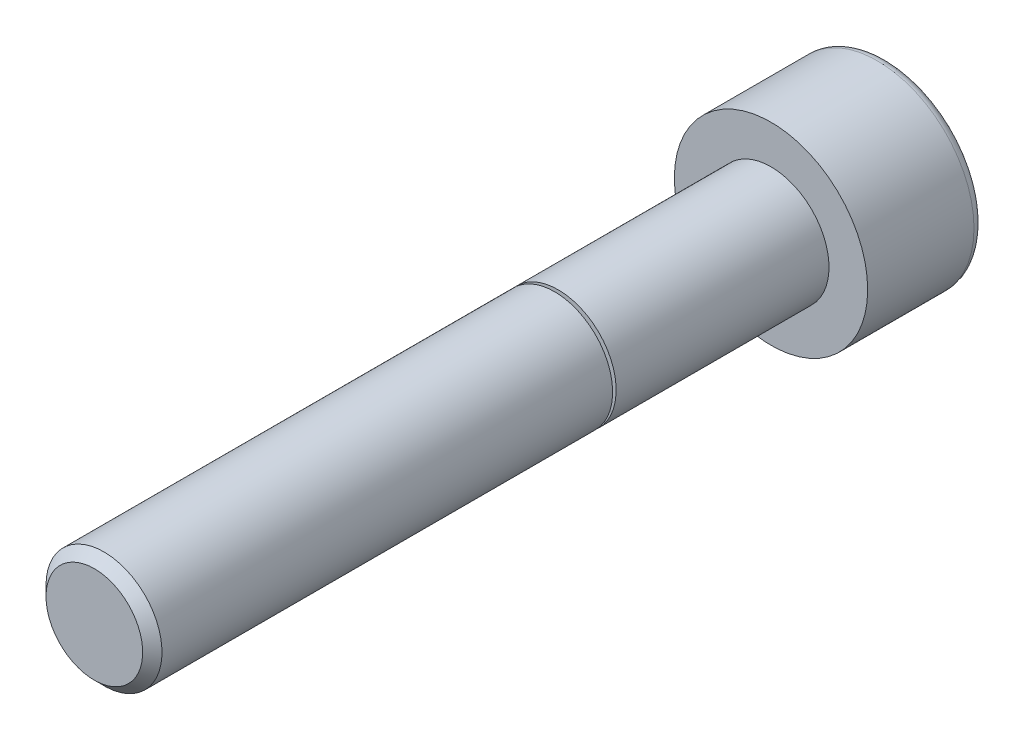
ISO-10303-21;
HEADER;
FILE_DESCRIPTION(('STEP AP214'),'2;1');
FILE_NAME('part.step','',(''),(''),'','','');
FILE_SCHEMA(('AUTOMOTIVE_DESIGN { 1 0 10303 214 1 1 1 1 }'));
ENDSEC;
DATA;
#1=APPLICATION_CONTEXT('core data for automotive mechanical design processes');
#2=APPLICATION_PROTOCOL_DEFINITION('international standard','automotive_design',2000,#1);
#3=PRODUCT_CONTEXT('',#1,'mechanical');
#4=PRODUCT('Part','Part','',(#3));
#5=PRODUCT_RELATED_PRODUCT_CATEGORY('part','',(#4));
#6=PRODUCT_DEFINITION_FORMATION('','',#4);
#7=PRODUCT_DEFINITION_CONTEXT('part definition',#1,'design');
#8=PRODUCT_DEFINITION('design','',#6,#7);
#9=PRODUCT_DEFINITION_SHAPE('','',#8);
#10=(LENGTH_UNIT() NAMED_UNIT(*) SI_UNIT(.MILLI.,.METRE.));
#11=(NAMED_UNIT(*) PLANE_ANGLE_UNIT() SI_UNIT($,.RADIAN.));
#12=(NAMED_UNIT(*) SI_UNIT($,.STERADIAN.) SOLID_ANGLE_UNIT());
#13=UNCERTAINTY_MEASURE_WITH_UNIT(LENGTH_MEASURE(1.E-05),#10,'distance_accuracy_value','');
#14=(GEOMETRIC_REPRESENTATION_CONTEXT(3) GLOBAL_UNCERTAINTY_ASSIGNED_CONTEXT((#13)) GLOBAL_UNIT_ASSIGNED_CONTEXT((#10,
#11,#12)) REPRESENTATION_CONTEXT('',''));
#15=CARTESIAN_POINT('',(0.,0.,0.));
#16=DIRECTION('',(0.,0.,1.));
#17=DIRECTION('',(1.,0.,0.));
#18=AXIS2_PLACEMENT_3D('',#15,#16,#17);
#19=CARTESIAN_POINT('',(0.,0.,-5.50000000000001));
#20=DIRECTION('',(0.,0.,-1.));
#21=DIRECTION('',(-1.,0.,0.));
#22=AXIS2_PLACEMENT_3D('',#19,#20,#21);
#23=TOROIDAL_SURFACE('',#22,4.5,0.500000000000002);
#24=CARTESIAN_POINT('',(0.,0.,-6.00000000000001));
#25=DIRECTION('',(0.,0.,-1.));
#26=DIRECTION('',(-1.,0.,0.));
#27=AXIS2_PLACEMENT_3D('',#24,#25,#26);
#28=CIRCLE('',#27,4.5);
#29=CARTESIAN_POINT('',(-4.5,0.,-6.00000000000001));
#30=VERTEX_POINT('',#29);
#31=EDGE_CURVE('E146',#30,#30,#28,.T.);
#32=ORIENTED_EDGE('',*,*,#31,.F.);
#33=EDGE_LOOP('',(#32));
#34=FACE_BOUND('',#33,.T.);
#35=CARTESIAN_POINT('',(0.,0.,-5.50000000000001));
#36=DIRECTION('',(0.,0.,-1.));
#37=DIRECTION('',(-1.,0.,0.));
#38=AXIS2_PLACEMENT_3D('',#35,#36,#37);
#39=CIRCLE('',#38,5.);
#40=CARTESIAN_POINT('',(-5.,0.,-5.50000000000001));
#41=VERTEX_POINT('',#40);
#42=EDGE_CURVE('E11',#41,#41,#39,.T.);
#43=ORIENTED_EDGE('',*,*,#42,.T.);
#44=EDGE_LOOP('',(#43));
#45=FACE_BOUND('',#44,.T.);
#46=ADVANCED_FACE('F45',(#34,#45),#23,.T.);
#47=CARTESIAN_POINT('',(0.,0.,-10.585154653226));
#48=DIRECTION('',(0.,0.,-1.));
#49=DIRECTION('',(-1.,0.,0.));
#50=AXIS2_PLACEMENT_3D('',#47,#48,#49);
#51=CYLINDRICAL_SURFACE('',#50,5.);
#52=ORIENTED_EDGE('',*,*,#42,.F.);
#53=EDGE_LOOP('',(#52));
#54=FACE_BOUND('',#53,.T.);
#55=CARTESIAN_POINT('',(0.,0.,0.));
#56=DIRECTION('',(0.,0.,-1.));
#57=DIRECTION('',(-1.,0.,0.));
#58=AXIS2_PLACEMENT_3D('',#55,#56,#57);
#59=CIRCLE('',#58,5.);
#60=CARTESIAN_POINT('',(-5.,0.,0.));
#61=VERTEX_POINT('',#60);
#62=EDGE_CURVE('E52',#61,#61,#59,.T.);
#63=ORIENTED_EDGE('',*,*,#62,.T.);
#64=EDGE_LOOP('',(#63));
#65=FACE_BOUND('',#64,.T.);
#66=ADVANCED_FACE('F177',(#54,#65),#51,.T.);
#67=CARTESIAN_POINT('',(-5.,0.,0.));
#68=DIRECTION('',(0.,0.,-1.));
#69=DIRECTION('',(-1.,0.,0.));
#70=AXIS2_PLACEMENT_3D('',#67,#68,#69);
#71=PLANE('',#70);
#72=ORIENTED_EDGE('',*,*,#62,.F.);
#73=EDGE_LOOP('',(#72));
#74=FACE_BOUND('',#73,.T.);
#75=CARTESIAN_POINT('',(0.,0.,0.));
#76=DIRECTION('',(0.,0.,-1.));
#77=DIRECTION('',(-1.,0.,0.));
#78=AXIS2_PLACEMENT_3D('',#75,#76,#77);
#79=CIRCLE('',#78,3.);
#80=CARTESIAN_POINT('',(-3.,0.,0.));
#81=VERTEX_POINT('',#80);
#82=EDGE_CURVE('E172',#81,#81,#79,.T.);
#83=ORIENTED_EDGE('',*,*,#82,.T.);
#84=EDGE_LOOP('',(#83));
#85=FACE_BOUND('',#84,.T.);
#86=ADVANCED_FACE('F179',(#74,#85),#71,.F.);
#87=CARTESIAN_POINT('',(0.,0.,-10.585154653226));
#88=DIRECTION('',(0.,0.,-1.));
#89=DIRECTION('',(-1.,0.,0.));
#90=AXIS2_PLACEMENT_3D('',#87,#88,#89);
#91=CYLINDRICAL_SURFACE('',#90,3.00000000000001);
#92=ORIENTED_EDGE('',*,*,#82,.F.);
#93=EDGE_LOOP('',(#92));
#94=FACE_BOUND('',#93,.T.);
#95=CARTESIAN_POINT('',(0.,0.,11.01));
#96=DIRECTION('',(0.,0.,-1.));
#97=DIRECTION('',(-1.,0.,0.));
#98=AXIS2_PLACEMENT_3D('',#95,#96,#97);
#99=CIRCLE('',#98,3.00000000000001);
#100=CARTESIAN_POINT('',(-3.00000000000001,0.,11.01));
#101=VERTEX_POINT('',#100);
#102=EDGE_CURVE('E169',#101,#101,#99,.T.);
#103=ORIENTED_EDGE('',*,*,#102,.T.);
#104=EDGE_LOOP('',(#103));
#105=FACE_BOUND('',#104,.T.);
#106=ADVANCED_FACE('F182',(#94,#105),#91,.T.);
#107=CARTESIAN_POINT('',(-3.,0.,11.01));
#108=DIRECTION('',(0.,0.,-1.));
#109=DIRECTION('',(-1.,0.,0.));
#110=AXIS2_PLACEMENT_3D('',#107,#108,#109);
#111=PLANE('',#110);
#112=ORIENTED_EDGE('',*,*,#102,.F.);
#113=EDGE_LOOP('',(#112));
#114=FACE_BOUND('',#113,.T.);
#115=CARTESIAN_POINT('',(0.,0.,11.01));
#116=DIRECTION('',(0.,0.,-1.));
#117=DIRECTION('',(-1.,0.,0.));
#118=AXIS2_PLACEMENT_3D('',#115,#116,#117);
#119=CIRCLE('',#118,2.61342563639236);
#120=CARTESIAN_POINT('',(-2.61342563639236,0.,11.01));
#121=VERTEX_POINT('',#120);
#122=EDGE_CURVE('E166',#121,#121,#119,.T.);
#123=ORIENTED_EDGE('',*,*,#122,.T.);
#124=EDGE_LOOP('',(#123));
#125=FACE_BOUND('',#124,.T.);
#126=ADVANCED_FACE('F188',(#114,#125),#111,.F.);
#127=CARTESIAN_POINT('',(0.,0.,11.03));
#128=DIRECTION('',(0.,0.,-1.));
#129=DIRECTION('',(-1.,0.,0.));
#130=AXIS2_PLACEMENT_3D('',#127,#128,#129);
#131=TOROIDAL_SURFACE('',#130,2.61342563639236,0.0199999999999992);
#132=ORIENTED_EDGE('',*,*,#122,.F.);
#133=EDGE_LOOP('',(#132));
#134=FACE_BOUND('',#133,.T.);
#135=CARTESIAN_POINT('',(0.,0.,11.0487938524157));
#136=DIRECTION('',(0.,0.,-1.));
#137=DIRECTION('',(-1.,0.,0.));
#138=AXIS2_PLACEMENT_3D('',#135,#136,#137);
#139=CIRCLE('',#138,2.60658523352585);
#140=CARTESIAN_POINT('',(-2.60658523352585,0.,11.0487938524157));
#141=VERTEX_POINT('',#140);
#142=EDGE_CURVE('E163',#141,#141,#139,.T.);
#143=ORIENTED_EDGE('',*,*,#142,.T.);
#144=EDGE_LOOP('',(#143));
#145=FACE_BOUND('',#144,.T.);
#146=ADVANCED_FACE('F194',(#134,#145),#131,.F.);
#147=CARTESIAN_POINT('',(0.,0.,11.1919851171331));
#148=DIRECTION('',(0.,0.,1.));
#149=DIRECTION('',(1.,0.,0.));
#150=AXIS2_PLACEMENT_3D('',#147,#148,#149);
#151=CONICAL_SURFACE('',#150,3.00000000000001,1.22173047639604);
#152=ORIENTED_EDGE('',*,*,#142,.F.);
#153=EDGE_LOOP('',(#152));
#154=FACE_BOUND('',#153,.T.);
#155=CARTESIAN_POINT('',(0.,0.,11.1919851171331));
#156=DIRECTION('',(0.,0.,-1.));
#157=DIRECTION('',(-1.,0.,0.));
#158=AXIS2_PLACEMENT_3D('',#155,#156,#157);
#159=CIRCLE('',#158,3.00000000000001);
#160=CARTESIAN_POINT('',(-3.00000000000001,0.,11.1919851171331));
#161=VERTEX_POINT('',#160);
#162=EDGE_CURVE('E160',#161,#161,#159,.T.);
#163=ORIENTED_EDGE('',*,*,#162,.T.);
#164=EDGE_LOOP('',(#163));
#165=FACE_BOUND('',#164,.T.);
#166=ADVANCED_FACE('F200',(#154,#165),#151,.T.);
#167=CARTESIAN_POINT('',(0.,0.,-10.585154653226));
#168=DIRECTION('',(0.,0.,-1.));
#169=DIRECTION('',(-1.,0.,0.));
#170=AXIS2_PLACEMENT_3D('',#167,#168,#169);
#171=CYLINDRICAL_SURFACE('',#170,3.00000000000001);
#172=ORIENTED_EDGE('',*,*,#162,.F.);
#173=EDGE_LOOP('',(#172));
#174=FACE_BOUND('',#173,.T.);
#175=CARTESIAN_POINT('',(0.,0.,34.5000000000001));
#176=DIRECTION('',(0.,0.,-1.));
#177=DIRECTION('',(-1.,0.,0.));
#178=AXIS2_PLACEMENT_3D('',#175,#176,#177);
#179=CIRCLE('',#178,3.00000000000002);
#180=CARTESIAN_POINT('',(-3.00000000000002,0.,34.5000000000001));
#181=VERTEX_POINT('',#180);
#182=EDGE_CURVE('E157',#181,#181,#179,.T.);
#183=ORIENTED_EDGE('',*,*,#182,.T.);
#184=EDGE_LOOP('',(#183));
#185=FACE_BOUND('',#184,.T.);
#186=ADVANCED_FACE('F206',(#174,#185),#171,.T.);
#187=CARTESIAN_POINT('',(0.,0.,35.0000000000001));
#188=DIRECTION('',(0.,0.,-1.));
#189=DIRECTION('',(-1.,0.,0.));
#190=AXIS2_PLACEMENT_3D('',#187,#188,#189);
#191=CONICAL_SURFACE('',#190,2.50000000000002,0.785398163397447);
#192=ORIENTED_EDGE('',*,*,#182,.F.);
#193=EDGE_LOOP('',(#192));
#194=FACE_BOUND('',#193,.T.);
#195=CARTESIAN_POINT('',(0.,0.,35.0000000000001));
#196=DIRECTION('',(0.,0.,-1.));
#197=DIRECTION('',(-1.,0.,0.));
#198=AXIS2_PLACEMENT_3D('',#195,#196,#197);
#199=CIRCLE('',#198,2.50000000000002);
#200=CARTESIAN_POINT('',(-2.50000000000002,0.,35.0000000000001));
#201=VERTEX_POINT('',#200);
#202=EDGE_CURVE('E154',#201,#201,#199,.T.);
#203=ORIENTED_EDGE('',*,*,#202,.T.);
#204=EDGE_LOOP('',(#203));
#205=FACE_BOUND('',#204,.T.);
#206=ADVANCED_FACE('F212',(#194,#205),#191,.T.);
#207=CARTESIAN_POINT('',(-2.50000000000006,0.,35.0000000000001));
#208=DIRECTION('',(0.,0.,-1.));
#209=DIRECTION('',(-1.,0.,0.));
#210=AXIS2_PLACEMENT_3D('',#207,#208,#209);
#211=PLANE('',#210);
#212=ORIENTED_EDGE('',*,*,#202,.F.);
#213=EDGE_LOOP('',(#212));
#214=FACE_BOUND('',#213,.T.);
#215=ADVANCED_FACE('F218',(#214),#211,.F.);
#216=CARTESIAN_POINT('',(0.,0.,-6.00000000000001));
#217=DIRECTION('',(0.,0.,1.));
#218=DIRECTION('',(1.,0.,0.));
#219=AXIS2_PLACEMENT_3D('',#216,#217,#218);
#220=PLANE('',#219);
#221=DIRECTION('',(-0.5,-0.866025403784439,0.));
#222=VECTOR('',#221,1.);
#223=CARTESIAN_POINT('',(2.88675134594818,0.,-6.00000000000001));
#224=LINE('',#223,#222);
#225=CARTESIAN_POINT('',(2.88675134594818,0.,-6.00000000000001));
#226=VERTEX_POINT('',#225);
#227=CARTESIAN_POINT('',(1.44337567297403,-2.5,-6.00000000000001));
#228=VERTEX_POINT('',#227);
#229=EDGE_CURVE('E133',#226,#228,#224,.T.);
#230=ORIENTED_EDGE('',*,*,#229,.F.);
#231=DIRECTION('',(0.5,-0.866025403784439,0.));
#232=VECTOR('',#231,1.);
#233=CARTESIAN_POINT('',(1.44337567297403,2.49999999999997,-6.00000000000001));
#234=LINE('',#233,#232);
#235=CARTESIAN_POINT('',(1.44337567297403,2.49999999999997,-6.00000000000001));
#236=VERTEX_POINT('',#235);
#237=EDGE_CURVE('E59',#236,#226,#234,.T.);
#238=ORIENTED_EDGE('',*,*,#237,.F.);
#239=DIRECTION('',(1.,0.,0.));
#240=VECTOR('',#239,1.);
#241=CARTESIAN_POINT('',(-1.44337567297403,2.49999999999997,-6.00000000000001));
#242=LINE('',#241,#240);
#243=CARTESIAN_POINT('',(-1.44337567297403,2.49999999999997,-6.00000000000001));
#244=VERTEX_POINT('',#243);
#245=EDGE_CURVE('E142',#244,#236,#242,.T.);
#246=ORIENTED_EDGE('',*,*,#245,.F.);
#247=DIRECTION('',(0.5,0.866025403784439,0.));
#248=VECTOR('',#247,1.);
#249=CARTESIAN_POINT('',(-2.88675134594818,0.,-6.00000000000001));
#250=LINE('',#249,#248);
#251=CARTESIAN_POINT('',(-2.88675134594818,0.,-6.00000000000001));
#252=VERTEX_POINT('',#251);
#253=EDGE_CURVE('E140',#252,#244,#250,.T.);
#254=ORIENTED_EDGE('',*,*,#253,.F.);
#255=DIRECTION('',(-0.5,0.866025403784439,0.));
#256=VECTOR('',#255,1.);
#257=CARTESIAN_POINT('',(-1.44337567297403,-2.5,-6.00000000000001));
#258=LINE('',#257,#256);
#259=CARTESIAN_POINT('',(-1.44337567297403,-2.5,-6.00000000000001));
#260=VERTEX_POINT('',#259);
#261=EDGE_CURVE('E107',#260,#252,#258,.T.);
#262=ORIENTED_EDGE('',*,*,#261,.F.);
#263=DIRECTION('',(-1.,0.,0.));
#264=VECTOR('',#263,1.);
#265=CARTESIAN_POINT('',(1.44337567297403,-2.5,-6.00000000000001));
#266=LINE('',#265,#264);
#267=EDGE_CURVE('E136',#228,#260,#266,.T.);
#268=ORIENTED_EDGE('',*,*,#267,.F.);
#269=EDGE_LOOP('',(#230,#238,#246,#254,#262,#268));
#270=FACE_BOUND('',#269,.T.);
#271=ORIENTED_EDGE('',*,*,#31,.T.);
#272=EDGE_LOOP('',(#271));
#273=FACE_BOUND('',#272,.T.);
#274=ADVANCED_FACE('F223',(#270,#273),#220,.F.);
#275=CARTESIAN_POINT('',(1.44337567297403,2.49999999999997,-3.5));
#276=DIRECTION('',(0.866025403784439,0.5,0.));
#277=DIRECTION('',(-0.5,0.866025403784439,0.));
#278=AXIS2_PLACEMENT_3D('',#275,#276,#277);
#279=PLANE('',#278);
#280=ORIENTED_EDGE('',*,*,#237,.T.);
#281=DIRECTION('',(0.,0.,-1.));
#282=VECTOR('',#281,1.);
#283=CARTESIAN_POINT('',(2.88675134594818,0.,-3.5));
#284=LINE('',#283,#282);
#285=CARTESIAN_POINT('',(2.88675134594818,0.,-3.5));
#286=VERTEX_POINT('',#285);
#287=EDGE_CURVE('E89',#286,#226,#284,.T.);
#288=ORIENTED_EDGE('',*,*,#287,.F.);
#289=DIRECTION('',(0.5,-0.866025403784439,0.));
#290=VECTOR('',#289,1.);
#291=CARTESIAN_POINT('',(1.44337567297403,2.49999999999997,-3.5));
#292=LINE('',#291,#290);
#293=CARTESIAN_POINT('',(1.44337567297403,2.49999999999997,-3.5));
#294=VERTEX_POINT('',#293);
#295=EDGE_CURVE('E144',#294,#286,#292,.T.);
#296=ORIENTED_EDGE('',*,*,#295,.F.);
#297=DIRECTION('',(0.,0.,-1.));
#298=VECTOR('',#297,1.);
#299=CARTESIAN_POINT('',(1.44337567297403,2.49999999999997,-3.5));
#300=LINE('',#299,#298);
#301=EDGE_CURVE('E67',#294,#236,#300,.T.);
#302=ORIENTED_EDGE('',*,*,#301,.T.);
#303=EDGE_LOOP('',(#280,#288,#296,#302));
#304=FACE_BOUND('',#303,.T.);
#305=ADVANCED_FACE('F229',(#304),#279,.F.);
#306=CARTESIAN_POINT('',(-1.44337567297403,2.49999999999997,-3.5));
#307=DIRECTION('',(0.,1.,0.));
#308=DIRECTION('',(0.,0.,1.));
#309=AXIS2_PLACEMENT_3D('',#306,#307,#308);
#310=PLANE('',#309);
#311=ORIENTED_EDGE('',*,*,#245,.T.);
#312=ORIENTED_EDGE('',*,*,#301,.F.);
#313=DIRECTION('',(1.,0.,0.));
#314=VECTOR('',#313,1.);
#315=CARTESIAN_POINT('',(-1.44337567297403,2.49999999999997,-3.5));
#316=LINE('',#315,#314);
#317=CARTESIAN_POINT('',(-1.44337567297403,2.49999999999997,-3.5));
#318=VERTEX_POINT('',#317);
#319=EDGE_CURVE('E119',#318,#294,#316,.T.);
#320=ORIENTED_EDGE('',*,*,#319,.F.);
#321=DIRECTION('',(0.,0.,-1.));
#322=VECTOR('',#321,1.);
#323=CARTESIAN_POINT('',(-1.44337567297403,2.49999999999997,-3.5));
#324=LINE('',#323,#322);
#325=EDGE_CURVE('E111',#318,#244,#324,.T.);
#326=ORIENTED_EDGE('',*,*,#325,.T.);
#327=EDGE_LOOP('',(#311,#312,#320,#326));
#328=FACE_BOUND('',#327,.T.);
#329=ADVANCED_FACE('F294',(#328),#310,.F.);
#330=CARTESIAN_POINT('',(-2.88675134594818,0.,-3.5));
#331=DIRECTION('',(-0.866025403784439,0.5,0.));
#332=DIRECTION('',(-0.5,-0.866025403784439,0.));
#333=AXIS2_PLACEMENT_3D('',#330,#331,#332);
#334=PLANE('',#333);
#335=ORIENTED_EDGE('',*,*,#253,.T.);
#336=ORIENTED_EDGE('',*,*,#325,.F.);
#337=DIRECTION('',(0.5,0.866025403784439,0.));
#338=VECTOR('',#337,1.);
#339=CARTESIAN_POINT('',(-2.88675134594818,0.,-3.5));
#340=LINE('',#339,#338);
#341=CARTESIAN_POINT('',(-2.88675134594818,0.,-3.5));
#342=VERTEX_POINT('',#341);
#343=EDGE_CURVE('E115',#342,#318,#340,.T.);
#344=ORIENTED_EDGE('',*,*,#343,.F.);
#345=DIRECTION('',(0.,0.,-1.));
#346=VECTOR('',#345,1.);
#347=CARTESIAN_POINT('',(-2.88675134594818,0.,-3.5));
#348=LINE('',#347,#346);
#349=EDGE_CURVE('E100',#342,#252,#348,.T.);
#350=ORIENTED_EDGE('',*,*,#349,.T.);
#351=EDGE_LOOP('',(#335,#336,#344,#350));
#352=FACE_BOUND('',#351,.T.);
#353=ADVANCED_FACE('F116',(#352),#334,.F.);
#354=CARTESIAN_POINT('',(-1.44337567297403,-2.5,-3.5));
#355=DIRECTION('',(-0.866025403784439,-0.5,0.));
#356=DIRECTION('',(0.5,-0.866025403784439,0.));
#357=AXIS2_PLACEMENT_3D('',#354,#355,#356);
#358=PLANE('',#357);
#359=ORIENTED_EDGE('',*,*,#261,.T.);
#360=ORIENTED_EDGE('',*,*,#349,.F.);
#361=DIRECTION('',(-0.5,0.866025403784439,0.));
#362=VECTOR('',#361,1.);
#363=CARTESIAN_POINT('',(-1.44337567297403,-2.5,-3.5));
#364=LINE('',#363,#362);
#365=CARTESIAN_POINT('',(-1.44337567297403,-2.5,-3.5));
#366=VERTEX_POINT('',#365);
#367=EDGE_CURVE('E104',#366,#342,#364,.T.);
#368=ORIENTED_EDGE('',*,*,#367,.F.);
#369=DIRECTION('',(0.,0.,-1.));
#370=VECTOR('',#369,1.);
#371=CARTESIAN_POINT('',(-1.44337567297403,-2.5,-3.5));
#372=LINE('',#371,#370);
#373=EDGE_CURVE('E112',#366,#260,#372,.T.);
#374=ORIENTED_EDGE('',*,*,#373,.T.);
#375=EDGE_LOOP('',(#359,#360,#368,#374));
#376=FACE_BOUND('',#375,.T.);
#377=ADVANCED_FACE('F102',(#376),#358,.F.);
#378=CARTESIAN_POINT('',(1.44337567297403,-2.5,-3.5));
#379=DIRECTION('',(0.,-1.,0.));
#380=DIRECTION('',(0.,0.,-1.));
#381=AXIS2_PLACEMENT_3D('',#378,#379,#380);
#382=PLANE('',#381);
#383=ORIENTED_EDGE('',*,*,#267,.T.);
#384=ORIENTED_EDGE('',*,*,#373,.F.);
#385=DIRECTION('',(-1.,0.,0.));
#386=VECTOR('',#385,1.);
#387=CARTESIAN_POINT('',(1.44337567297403,-2.5,-3.5));
#388=LINE('',#387,#386);
#389=CARTESIAN_POINT('',(1.44337567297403,-2.5,-3.5));
#390=VERTEX_POINT('',#389);
#391=EDGE_CURVE('E125',#390,#366,#388,.T.);
#392=ORIENTED_EDGE('',*,*,#391,.F.);
#393=DIRECTION('',(0.,0.,-1.));
#394=VECTOR('',#393,1.);
#395=CARTESIAN_POINT('',(1.44337567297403,-2.5,-3.5));
#396=LINE('',#395,#394);
#397=EDGE_CURVE('E149',#390,#228,#396,.T.);
#398=ORIENTED_EDGE('',*,*,#397,.T.);
#399=EDGE_LOOP('',(#383,#384,#392,#398));
#400=FACE_BOUND('',#399,.T.);
#401=ADVANCED_FACE('F319',(#400),#382,.F.);
#402=CARTESIAN_POINT('',(2.88675134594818,0.,-3.5));
#403=DIRECTION('',(0.866025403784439,-0.5,0.));
#404=DIRECTION('',(0.5,0.866025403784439,0.));
#405=AXIS2_PLACEMENT_3D('',#402,#403,#404);
#406=PLANE('',#405);
#407=ORIENTED_EDGE('',*,*,#229,.T.);
#408=ORIENTED_EDGE('',*,*,#397,.F.);
#409=DIRECTION('',(-0.5,-0.866025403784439,0.));
#410=VECTOR('',#409,1.);
#411=CARTESIAN_POINT('',(2.88675134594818,0.,-3.5));
#412=LINE('',#411,#410);
#413=EDGE_CURVE('E127',#286,#390,#412,.T.);
#414=ORIENTED_EDGE('',*,*,#413,.F.);
#415=ORIENTED_EDGE('',*,*,#287,.T.);
#416=EDGE_LOOP('',(#407,#408,#414,#415));
#417=FACE_BOUND('',#416,.T.);
#418=ADVANCED_FACE('F328',(#417),#406,.F.);
#419=CARTESIAN_POINT('',(4.33012701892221,-2.5,-3.5));
#420=DIRECTION('',(0.,0.,-1.));
#421=DIRECTION('',(-1.,0.,0.));
#422=AXIS2_PLACEMENT_3D('',#419,#420,#421);
#423=PLANE('',#422);
#424=ORIENTED_EDGE('',*,*,#295,.T.);
#425=ORIENTED_EDGE('',*,*,#413,.T.);
#426=ORIENTED_EDGE('',*,*,#391,.T.);
#427=ORIENTED_EDGE('',*,*,#367,.T.);
#428=ORIENTED_EDGE('',*,*,#343,.T.);
#429=ORIENTED_EDGE('',*,*,#319,.T.);
#430=EDGE_LOOP('',(#424,#425,#426,#427,#428,#429));
#431=FACE_BOUND('',#430,.T.);
#432=ADVANCED_FACE('F122',(#431),#423,.T.);
#433=CLOSED_SHELL('',(#46,#66,#86,#106,#126,#146,#166,#186,#206,#215,#274,#305,#329,#353,#377,
#401,#418,#432));
#434=MANIFOLD_SOLID_BREP('B2',#433);
#435=ADVANCED_BREP_SHAPE_REPRESENTATION('',(#18,#434),#14);
#436=SHAPE_DEFINITION_REPRESENTATION(#9,#435);
ENDSEC;
END-ISO-10303-21;
